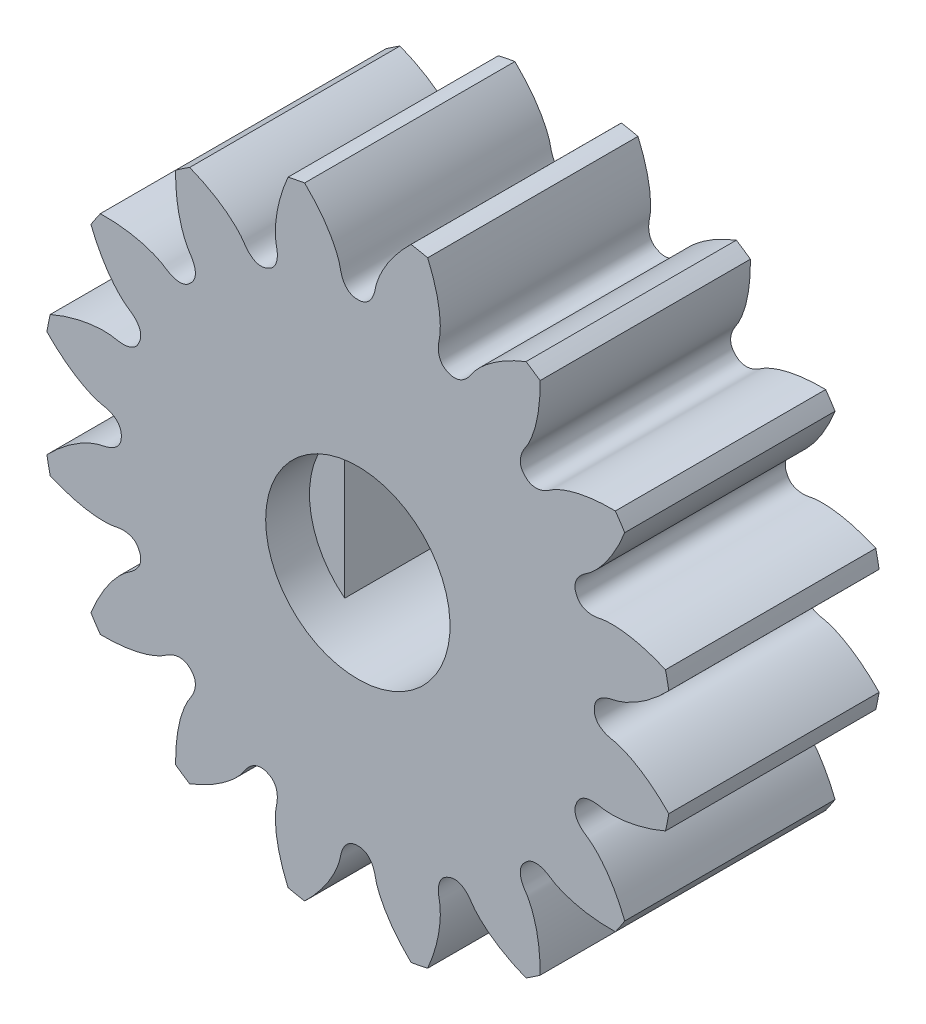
from build123d import *

# Parameters (mm, degrees)
SKETCHREVOLVESPURGEAR1_W       = 6
SKETCHREVOLVESPURGEAR1_H       = 8.999999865
TOOTHEXTRUDECUTSPURGEAR1_DEPTH = 3
PATTERNSPURGEAR1_COUNT         = 16
CUT_EXTRUDE_1_DEPTH            = 14.906455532
SKETCH_2_R                     = 2.63
CUT_EXTRUDE_2_DEPTH            = 1.25


with BuildPart() as part:
    # SketchRevolveSpurGear1 → SpurGear1 (revolve)
    with BuildSketch(Plane(origin=(0, 0, 0), x_dir=(0, 0, -1), z_dir=(1, 0, 0)), mode=Mode.PRIVATE) as spurgear1_sk:
        with Locations((0, 4.499999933)):
            Rectangle(SKETCHREVOLVESPURGEAR1_W, SKETCHREVOLVESPURGEAR1_H)
    revolve(spurgear1_sk.sketch.rotate(Axis((0, 0, 0), (0, 0, -1)), 90), axis=Axis((0, 0, 0), (0, 0, -1)))

    # SketchToothSpurGear1 → ToothExtrudeCutSpurGear1 (cut, symmetric)
    with BuildSketch(Plane.XY):
        with BuildLine():
            ThreePointArc((8.913944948, 1.563356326), (9.049999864, 0), (8.913944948, -1.563356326))
            add(Edge.make_bspline(
                [(8.913944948, -1.563356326), (8.868863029, -1.515505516), (8.800817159, -1.445862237), (8.708716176, -1.356799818), (8.641180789, -1.293889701), (8.57436478, -1.233940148), (8.508354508, -1.176901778), (8.44323473, -1.122723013), (8.379088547, -1.07135014), (8.315997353, -1.022727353), (8.254040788, -0.976796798), (8.193296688, -0.933498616), (8.133841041, -0.892770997), (8.07574794, -0.854550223), (8.019089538, -0.818770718), (7.963936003, -0.785365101), (7.910355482, -0.754264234), (7.858414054, -0.725397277), (7.808175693, -0.698691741), (7.75970223, -0.67407354), (7.713053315, -0.651467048), (7.668286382, -0.630795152), (7.625456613, -0.611979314), (7.584616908, -0.594939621), (7.545817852, -0.579594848), (7.509107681, -0.565862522), (7.474532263, -0.553658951), (7.442135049, -0.542899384), (7.411957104, -0.533497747), (7.384036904, -0.525367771), (7.358410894, -0.518419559), (7.335111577, -0.512571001), (7.314173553, -0.507711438), (7.265857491, -0.497571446), (7.212342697, -0.488237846), (7.154748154, -0.472299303), (7.120909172, -0.461714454), (7.088091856, -0.449983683), (7.056266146, -0.437102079), (7.025413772, -0.422991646), (6.995517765, -0.407568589), (6.966570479, -0.390721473), (6.938579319, -0.37231299), (6.911576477, -0.352176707), (6.885631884, -0.330117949), (6.860870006, -0.305918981), (6.837490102, -0.279352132), (6.815786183, -0.250204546), (6.796166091, -0.218317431), (6.77914105, -0.183641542), (6.76534973, -0.146296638), (6.755311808, -0.106642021), (6.750608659, -0.069569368), (6.748613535, -0.033870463), (6.749524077, 0), (6.748613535, 0.033870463), (6.750608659, 0.069569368), (6.755311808, 0.106642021), (6.76534973, 0.146296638), (6.77914105, 0.183641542), (6.796166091, 0.218317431), (6.815786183, 0.250204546), (6.837490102, 0.279352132), (6.860870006, 0.305918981), (6.885631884, 0.330117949), (6.911576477, 0.352176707), (6.938579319, 0.37231299), (6.966570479, 0.390721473), (6.995517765, 0.407568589), (7.025413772, 0.422991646), (7.056266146, 0.437102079), (7.088091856, 0.449983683), (7.120909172, 0.461714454), (7.154748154, 0.472299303), (7.212342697, 0.488237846), (7.265857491, 0.497571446), (7.314173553, 0.507711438), (7.335111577, 0.512571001), (7.358410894, 0.518419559), (7.384036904, 0.525367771), (7.411957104, 0.533497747), (7.442135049, 0.542899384), (7.474532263, 0.553658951), (7.509107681, 0.565862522), (7.545817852, 0.579594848), (7.584616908, 0.594939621), (7.625456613, 0.611979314), (7.668286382, 0.630795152), (7.713053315, 0.651467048), (7.75970223, 0.67407354), (7.808175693, 0.698691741), (7.858414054, 0.725397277), (7.910355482, 0.754264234), (7.963936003, 0.785365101), (8.019089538, 0.818770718), (8.07574794, 0.854550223), (8.133841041, 0.892770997), (8.193296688, 0.933498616), (8.254040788, 0.976796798), (8.315997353, 1.022727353), (8.379088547, 1.07135014), (8.44323473, 1.122723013), (8.508354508, 1.176901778), (8.57436478, 1.233940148), (8.641180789, 1.293889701), (8.708716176, 1.356799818), (8.800817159, 1.445862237), (8.868863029, 1.515505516), (8.913944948, 1.563356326)],
                knots=[0, 0, 0, 0, 0.035461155, 0.052509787, 0.069103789, 0.085243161, 0.100927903, 0.116158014, 0.130933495, 0.145254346, 0.159120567, 0.172532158, 0.185489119, 0.197991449, 0.210039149, 0.221632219, 0.232770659, 0.243454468, 0.253683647, 0.263458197, 0.272778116, 0.281643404, 0.290054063, 0.298010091, 0.305511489, 0.312558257, 0.319150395, 0.325287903, 0.33097078, 0.336199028, 0.340972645, 0.345291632, 0.349155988, 0.352565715, 0.371921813, 0.378415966, 0.38478511, 0.39104383, 0.397208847, 0.403299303, 0.409337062, 0.415346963, 0.421356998, 0.4273983, 0.433504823, 0.439712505, 0.446057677, 0.452574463, 0.459291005, 0.466224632, 0.473376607, 0.480727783, 0.488236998, 0.493496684, 0.5, 0.506503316, 0.511763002, 0.519272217, 0.526623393, 0.533775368, 0.540708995, 0.547425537, 0.553942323, 0.560287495, 0.566495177, 0.5726017, 0.578643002, 0.584653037, 0.590662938, 0.596700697, 0.602791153, 0.60895617, 0.61521489, 0.621584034, 0.628078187, 0.647434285, 0.650844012, 0.654708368, 0.659027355, 0.663800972, 0.66902922, 0.674712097, 0.680849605, 0.687441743, 0.694488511, 0.701989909, 0.709945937, 0.718356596, 0.727221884, 0.736541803, 0.746316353, 0.756545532, 0.767229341, 0.778367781, 0.789960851, 0.802008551, 0.814510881, 0.827467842, 0.840879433, 0.854745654, 0.869066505, 0.883841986, 0.899072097, 0.914756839, 0.930896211, 0.947490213, 0.964538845, 1, 1, 1, 1], degree=3))
        make_face()
    toothextrudecutspurgear1 = extrude(amount=TOOTHEXTRUDECUTSPURGEAR1_DEPTH, both=True, mode=Mode.SUBTRACT)

    # PatternSpurGear1: ToothExtrudeCutSpurGear1 ×16 about axis
    patternspurgear1_axis = Axis((0, 0, 50), (0, 0, -1))
    for i in range(1, PATTERNSPURGEAR1_COUNT):
        add(toothextrudecutspurgear1.rotate(patternspurgear1_axis, i * 360 / PATTERNSPURGEAR1_COUNT), mode=Mode.SUBTRACT)

    # Sketch 1 → Cut-Extrude 1 (cut, through all)
    with BuildSketch(Plane.XY.offset(3)):
        with BuildLine():
            Line((-1.625, -2.067915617), (-1.625, 2.067915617))
            ThreePointArc((-1.625, 2.067915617), (0, 2.63), (1.625, 2.067915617))
            Line((1.625, 2.067915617), (1.625, -2.067915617))
            ThreePointArc((1.625, -2.067915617), (0, -2.63), (-1.625, -2.067915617))
        make_face()
    extrude(amount=-CUT_EXTRUDE_1_DEPTH, mode=Mode.SUBTRACT)

    # Sketch 2 → Cut-Extrude 2 (cut)
    with BuildSketch(Plane.XY.offset(3)):
        with Locations(Location((0, 0, 0), (0, 0, 51.839190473))):
            Circle(SKETCH_2_R)
    extrude(amount=-CUT_EXTRUDE_2_DEPTH, mode=Mode.SUBTRACT)


solid = part.part
